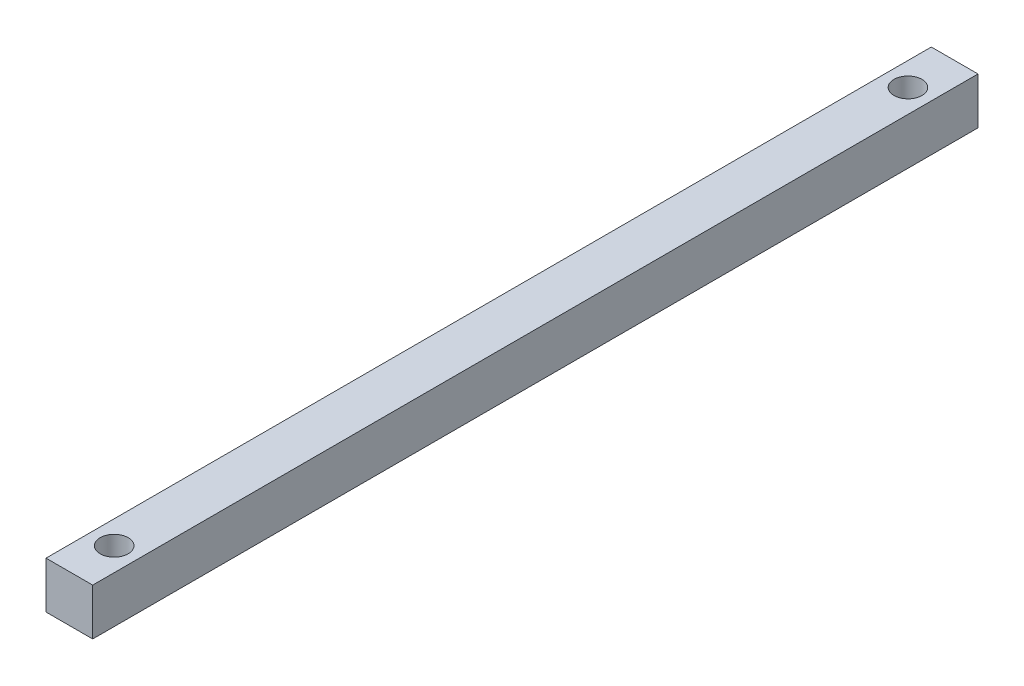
ISO-10303-21;
HEADER;
FILE_DESCRIPTION(('STEP AP214'),'2;1');
FILE_NAME('part.step','',(''),(''),'','','');
FILE_SCHEMA(('AUTOMOTIVE_DESIGN { 1 0 10303 214 1 1 1 1 }'));
ENDSEC;
DATA;
#1=APPLICATION_CONTEXT('core data for automotive mechanical design processes');
#2=APPLICATION_PROTOCOL_DEFINITION('international standard','automotive_design',2000,#1);
#3=PRODUCT_CONTEXT('',#1,'mechanical');
#4=PRODUCT('Part','Part','',(#3));
#5=PRODUCT_RELATED_PRODUCT_CATEGORY('part','',(#4));
#6=PRODUCT_DEFINITION_FORMATION('','',#4);
#7=PRODUCT_DEFINITION_CONTEXT('part definition',#1,'design');
#8=PRODUCT_DEFINITION('design','',#6,#7);
#9=PRODUCT_DEFINITION_SHAPE('','',#8);
#10=(LENGTH_UNIT() NAMED_UNIT(*) SI_UNIT(.MILLI.,.METRE.));
#11=(NAMED_UNIT(*) PLANE_ANGLE_UNIT() SI_UNIT($,.RADIAN.));
#12=(NAMED_UNIT(*) SI_UNIT($,.STERADIAN.) SOLID_ANGLE_UNIT());
#13=UNCERTAINTY_MEASURE_WITH_UNIT(LENGTH_MEASURE(1.E-05),#10,'distance_accuracy_value','');
#14=(GEOMETRIC_REPRESENTATION_CONTEXT(3) GLOBAL_UNCERTAINTY_ASSIGNED_CONTEXT((#13)) GLOBAL_UNIT_ASSIGNED_CONTEXT((#10,
#11,#12)) REPRESENTATION_CONTEXT('',''));
#15=CARTESIAN_POINT('',(0.,0.,0.));
#16=DIRECTION('',(0.,0.,1.));
#17=DIRECTION('',(1.,0.,0.));
#18=AXIS2_PLACEMENT_3D('',#15,#16,#17);
#19=CARTESIAN_POINT('',(0.,0.,948.));
#20=DIRECTION('',(1.,0.,0.));
#21=DIRECTION('',(0.,1.,0.));
#22=AXIS2_PLACEMENT_3D('',#19,#20,#21);
#23=PLANE('',#22);
#24=DIRECTION('',(0.,-1.,0.));
#25=VECTOR('',#24,1.);
#26=CARTESIAN_POINT('',(0.,0.,0.));
#27=LINE('',#26,#25);
#28=CARTESIAN_POINT('',(0.,0.,0.));
#29=VERTEX_POINT('',#28);
#30=CARTESIAN_POINT('',(0.,-50.,0.));
#31=VERTEX_POINT('',#30);
#32=EDGE_CURVE('E95',#29,#31,#27,.T.);
#33=ORIENTED_EDGE('',*,*,#32,.T.);
#34=DIRECTION('',(0.,0.,-1.));
#35=VECTOR('',#34,1.);
#36=CARTESIAN_POINT('',(0.,-50.,948.));
#37=LINE('',#36,#35);
#38=CARTESIAN_POINT('',(0.,-50.,948.));
#39=VERTEX_POINT('',#38);
#40=EDGE_CURVE('E11',#39,#31,#37,.T.);
#41=ORIENTED_EDGE('',*,*,#40,.F.);
#42=DIRECTION('',(0.,-1.,0.));
#43=VECTOR('',#42,1.);
#44=CARTESIAN_POINT('',(0.,0.,948.));
#45=LINE('',#44,#43);
#46=CARTESIAN_POINT('',(0.,0.,948.));
#47=VERTEX_POINT('',#46);
#48=EDGE_CURVE('E83',#47,#39,#45,.T.);
#49=ORIENTED_EDGE('',*,*,#48,.F.);
#50=DIRECTION('',(0.,0.,-1.));
#51=VECTOR('',#50,1.);
#52=CARTESIAN_POINT('',(0.,0.,948.));
#53=LINE('',#52,#51);
#54=EDGE_CURVE('E91',#47,#29,#53,.T.);
#55=ORIENTED_EDGE('',*,*,#54,.T.);
#56=EDGE_LOOP('',(#33,#41,#49,#55));
#57=FACE_BOUND('',#56,.T.);
#58=ADVANCED_FACE('F32',(#57),#23,.F.);
#59=CARTESIAN_POINT('',(0.,-50.,948.));
#60=DIRECTION('',(0.,1.,0.));
#61=DIRECTION('',(0.,0.,1.));
#62=AXIS2_PLACEMENT_3D('',#59,#60,#61);
#63=PLANE('',#62);
#64=CARTESIAN_POINT('',(25.,-50.,50.));
#65=DIRECTION('',(0.,-1.,0.));
#66=DIRECTION('',(0.,0.,-1.));
#67=AXIS2_PLACEMENT_3D('',#64,#65,#66);
#68=CIRCLE('',#67,15.);
#69=CARTESIAN_POINT('',(25.,-50.,35.));
#70=VERTEX_POINT('',#69);
#71=EDGE_CURVE('E112',#70,#70,#68,.T.);
#72=ORIENTED_EDGE('',*,*,#71,.F.);
#73=EDGE_LOOP('',(#72));
#74=FACE_BOUND('',#73,.T.);
#75=CARTESIAN_POINT('',(25.,-50.,900.));
#76=DIRECTION('',(0.,-1.,0.));
#77=DIRECTION('',(0.,0.,-1.));
#78=AXIS2_PLACEMENT_3D('',#75,#76,#77);
#79=CIRCLE('',#78,15.);
#80=CARTESIAN_POINT('',(25.,-50.,885.));
#81=VERTEX_POINT('',#80);
#82=EDGE_CURVE('E109',#81,#81,#79,.T.);
#83=ORIENTED_EDGE('',*,*,#82,.F.);
#84=EDGE_LOOP('',(#83));
#85=FACE_BOUND('',#84,.T.);
#86=DIRECTION('',(1.,0.,0.));
#87=VECTOR('',#86,1.);
#88=CARTESIAN_POINT('',(0.,-50.,0.));
#89=LINE('',#88,#87);
#90=CARTESIAN_POINT('',(50.,-50.,0.));
#91=VERTEX_POINT('',#90);
#92=EDGE_CURVE('E87',#31,#91,#89,.T.);
#93=ORIENTED_EDGE('',*,*,#92,.T.);
#94=DIRECTION('',(0.,0.,-1.));
#95=VECTOR('',#94,1.);
#96=CARTESIAN_POINT('',(50.,-50.,948.));
#97=LINE('',#96,#95);
#98=CARTESIAN_POINT('',(50.,-50.,948.));
#99=VERTEX_POINT('',#98);
#100=EDGE_CURVE('E40',#99,#91,#97,.T.);
#101=ORIENTED_EDGE('',*,*,#100,.F.);
#102=DIRECTION('',(1.,0.,0.));
#103=VECTOR('',#102,1.);
#104=CARTESIAN_POINT('',(0.,-50.,948.));
#105=LINE('',#104,#103);
#106=EDGE_CURVE('E78',#39,#99,#105,.T.);
#107=ORIENTED_EDGE('',*,*,#106,.F.);
#108=ORIENTED_EDGE('',*,*,#40,.T.);
#109=EDGE_LOOP('',(#93,#101,#107,#108));
#110=FACE_BOUND('',#109,.T.);
#111=ADVANCED_FACE('F86',(#74,#85,#110),#63,.F.);
#112=CARTESIAN_POINT('',(50.,0.,948.));
#113=DIRECTION('',(-1.,0.,0.));
#114=DIRECTION('',(0.,-1.,0.));
#115=AXIS2_PLACEMENT_3D('',#112,#113,#114);
#116=PLANE('',#115);
#117=DIRECTION('',(0.,1.,0.));
#118=VECTOR('',#117,1.);
#119=CARTESIAN_POINT('',(50.,0.,0.));
#120=LINE('',#119,#118);
#121=CARTESIAN_POINT('',(50.,0.,0.));
#122=VERTEX_POINT('',#121);
#123=EDGE_CURVE('E65',#91,#122,#120,.T.);
#124=ORIENTED_EDGE('',*,*,#123,.T.);
#125=DIRECTION('',(0.,0.,-1.));
#126=VECTOR('',#125,1.);
#127=CARTESIAN_POINT('',(50.,0.,948.));
#128=LINE('',#127,#126);
#129=CARTESIAN_POINT('',(50.,0.,948.));
#130=VERTEX_POINT('',#129);
#131=EDGE_CURVE('E88',#130,#122,#128,.T.);
#132=ORIENTED_EDGE('',*,*,#131,.F.);
#133=DIRECTION('',(0.,1.,0.));
#134=VECTOR('',#133,1.);
#135=CARTESIAN_POINT('',(50.,0.,948.));
#136=LINE('',#135,#134);
#137=EDGE_CURVE('E81',#99,#130,#136,.T.);
#138=ORIENTED_EDGE('',*,*,#137,.F.);
#139=ORIENTED_EDGE('',*,*,#100,.T.);
#140=EDGE_LOOP('',(#124,#132,#138,#139));
#141=FACE_BOUND('',#140,.T.);
#142=ADVANCED_FACE('F89',(#141),#116,.F.);
#143=CARTESIAN_POINT('',(0.,0.,948.));
#144=DIRECTION('',(0.,-1.,0.));
#145=DIRECTION('',(0.,0.,-1.));
#146=AXIS2_PLACEMENT_3D('',#143,#144,#145);
#147=PLANE('',#146);
#148=CARTESIAN_POINT('',(25.,0.,50.));
#149=DIRECTION('',(0.,-1.,0.));
#150=DIRECTION('',(0.,0.,-1.));
#151=AXIS2_PLACEMENT_3D('',#148,#149,#150);
#152=CIRCLE('',#151,15.);
#153=CARTESIAN_POINT('',(25.,0.,35.));
#154=VERTEX_POINT('',#153);
#155=EDGE_CURVE('E115',#154,#154,#152,.T.);
#156=ORIENTED_EDGE('',*,*,#155,.T.);
#157=EDGE_LOOP('',(#156));
#158=FACE_BOUND('',#157,.T.);
#159=CARTESIAN_POINT('',(25.,0.,900.));
#160=DIRECTION('',(0.,-1.,0.));
#161=DIRECTION('',(0.,0.,-1.));
#162=AXIS2_PLACEMENT_3D('',#159,#160,#161);
#163=CIRCLE('',#162,15.);
#164=CARTESIAN_POINT('',(25.,0.,885.));
#165=VERTEX_POINT('',#164);
#166=EDGE_CURVE('E98',#165,#165,#163,.T.);
#167=ORIENTED_EDGE('',*,*,#166,.T.);
#168=EDGE_LOOP('',(#167));
#169=FACE_BOUND('',#168,.T.);
#170=DIRECTION('',(-1.,0.,0.));
#171=VECTOR('',#170,1.);
#172=CARTESIAN_POINT('',(0.,0.,0.));
#173=LINE('',#172,#171);
#174=EDGE_CURVE('E71',#122,#29,#173,.T.);
#175=ORIENTED_EDGE('',*,*,#174,.T.);
#176=ORIENTED_EDGE('',*,*,#54,.F.);
#177=DIRECTION('',(-1.,0.,0.));
#178=VECTOR('',#177,1.);
#179=CARTESIAN_POINT('',(0.,0.,948.));
#180=LINE('',#179,#178);
#181=EDGE_CURVE('E48',#130,#47,#180,.T.);
#182=ORIENTED_EDGE('',*,*,#181,.F.);
#183=ORIENTED_EDGE('',*,*,#131,.T.);
#184=EDGE_LOOP('',(#175,#176,#182,#183));
#185=FACE_BOUND('',#184,.T.);
#186=ADVANCED_FACE('F103',(#158,#169,#185),#147,.F.);
#187=CARTESIAN_POINT('',(0.,-50.,948.));
#188=DIRECTION('',(0.,0.,1.));
#189=DIRECTION('',(1.,0.,0.));
#190=AXIS2_PLACEMENT_3D('',#187,#188,#189);
#191=PLANE('',#190);
#192=ORIENTED_EDGE('',*,*,#48,.T.);
#193=ORIENTED_EDGE('',*,*,#106,.T.);
#194=ORIENTED_EDGE('',*,*,#137,.T.);
#195=ORIENTED_EDGE('',*,*,#181,.T.);
#196=EDGE_LOOP('',(#192,#193,#194,#195));
#197=FACE_BOUND('',#196,.T.);
#198=ADVANCED_FACE('F79',(#197),#191,.T.);
#199=CARTESIAN_POINT('',(0.,-50.,0.));
#200=DIRECTION('',(0.,0.,1.));
#201=DIRECTION('',(1.,0.,0.));
#202=AXIS2_PLACEMENT_3D('',#199,#200,#201);
#203=PLANE('',#202);
#204=ORIENTED_EDGE('',*,*,#32,.F.);
#205=ORIENTED_EDGE('',*,*,#174,.F.);
#206=ORIENTED_EDGE('',*,*,#123,.F.);
#207=ORIENTED_EDGE('',*,*,#92,.F.);
#208=EDGE_LOOP('',(#204,#205,#206,#207));
#209=FACE_BOUND('',#208,.T.);
#210=ADVANCED_FACE('F106',(#209),#203,.F.);
#211=CARTESIAN_POINT('',(25.,0.,900.));
#212=DIRECTION('',(0.,-1.,0.));
#213=DIRECTION('',(0.,0.,-1.));
#214=AXIS2_PLACEMENT_3D('',#211,#212,#213);
#215=CYLINDRICAL_SURFACE('',#214,15.);
#216=ORIENTED_EDGE('',*,*,#166,.F.);
#217=EDGE_LOOP('',(#216));
#218=FACE_BOUND('',#217,.T.);
#219=ORIENTED_EDGE('',*,*,#82,.T.);
#220=EDGE_LOOP('',(#219));
#221=FACE_BOUND('',#220,.T.);
#222=ADVANCED_FACE('F127',(#218,#221),#215,.F.);
#223=CARTESIAN_POINT('',(25.,0.,50.));
#224=DIRECTION('',(0.,-1.,0.));
#225=DIRECTION('',(0.,0.,-1.));
#226=AXIS2_PLACEMENT_3D('',#223,#224,#225);
#227=CYLINDRICAL_SURFACE('',#226,15.);
#228=ORIENTED_EDGE('',*,*,#155,.F.);
#229=EDGE_LOOP('',(#228));
#230=FACE_BOUND('',#229,.T.);
#231=ORIENTED_EDGE('',*,*,#71,.T.);
#232=EDGE_LOOP('',(#231));
#233=FACE_BOUND('',#232,.T.);
#234=ADVANCED_FACE('F121',(#230,#233),#227,.F.);
#235=CLOSED_SHELL('',(#58,#111,#142,#186,#198,#210,#222,#234));
#236=MANIFOLD_SOLID_BREP('B2',#235);
#237=ADVANCED_BREP_SHAPE_REPRESENTATION('',(#18,#236),#14);
#238=SHAPE_DEFINITION_REPRESENTATION(#9,#237);
ENDSEC;
END-ISO-10303-21;
